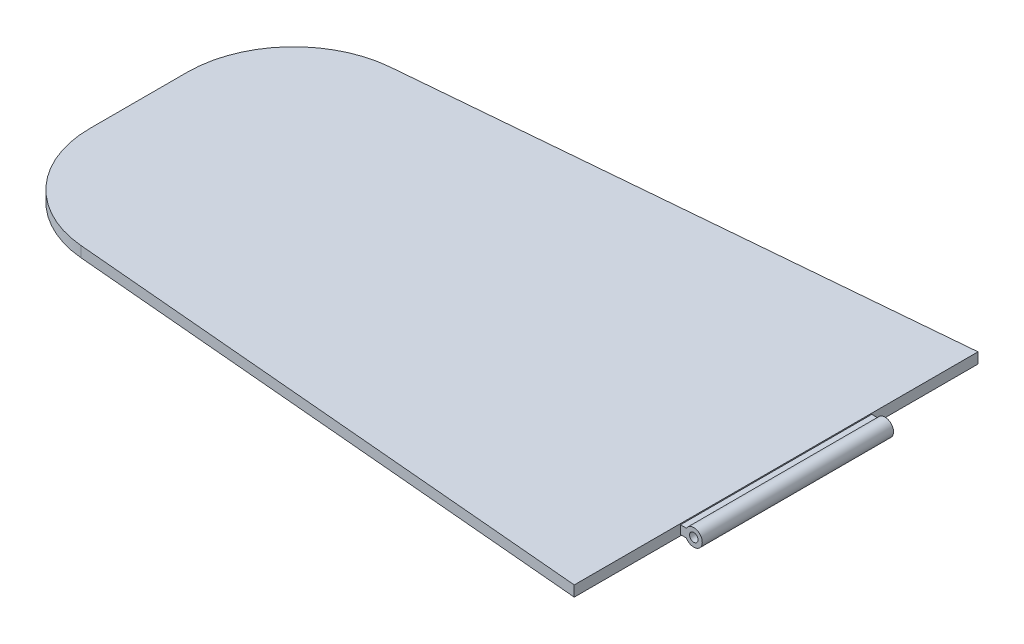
from build123d import *

# Parameters (mm, degrees)
BOSS_EXTRUDE1_DEPTH = 10
SKETCH2_R           = 4
BOSS_EXTRUDE2_DEPTH = 90


with BuildPart() as part:
    # Sketch1 → Boss-Extrude1 (new body)
    with BuildSketch(Plane(origin=(0, 0, 0), x_dir=(1, 0, 0), z_dir=(0, 1, 0))):
        with BuildLine():
            Line((0, 190), (0, -190))
            Line((0, -190), (-508.715574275, -145.493154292))
            ThreePointArc((-508.715574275, -145.493154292), (-573.727733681, -113.432705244), (-600, -45.873684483))
            Line((-600, -45.873684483), (-600, 45.873684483))
            ThreePointArc((-600, 45.873684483), (-573.727733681, 113.432705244), (-508.715574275, 145.493154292))
            Line((-508.715574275, 145.493154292), (0, 190))
        make_face()
    extrude(amount=BOSS_EXTRUDE1_DEPTH)

    # Sketch2 → Boss-Extrude2 (add, symmetric)
    with BuildSketch(Plane.XY):
        with BuildLine():
            Line((0, 9), (5.57179677, 9))
            ThreePointArc((5.57179677, 9), (20.5, 5), (5.57179677, 1))
            Line((5.57179677, 1), (0, 1))
            Line((0, 1), (0, 9))
        make_face()
        with Locations(Location((12.5, 5, 0), (0, 0, 180))):
            Circle(SKETCH2_R, mode=Mode.SUBTRACT)
    extrude(amount=BOSS_EXTRUDE2_DEPTH, both=True)


solid = part.part
